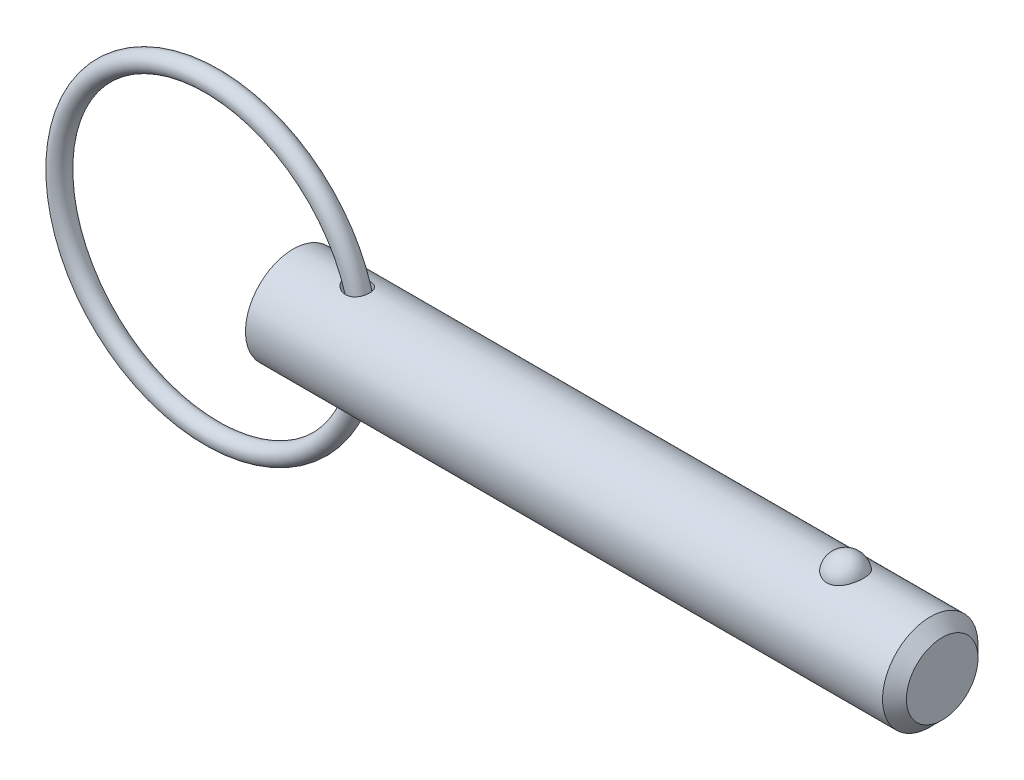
ISO-10303-21;
HEADER;
FILE_DESCRIPTION(('STEP AP214'),'2;1');
FILE_NAME('part.step','',(''),(''),'','','');
FILE_SCHEMA(('AUTOMOTIVE_DESIGN { 1 0 10303 214 1 1 1 1 }'));
ENDSEC;
DATA;
#1=APPLICATION_CONTEXT('core data for automotive mechanical design processes');
#2=APPLICATION_PROTOCOL_DEFINITION('international standard','automotive_design',2000,#1);
#3=PRODUCT_CONTEXT('',#1,'mechanical');
#4=PRODUCT('Part','Part','',(#3));
#5=PRODUCT_RELATED_PRODUCT_CATEGORY('part','',(#4));
#6=PRODUCT_DEFINITION_FORMATION('','',#4);
#7=PRODUCT_DEFINITION_CONTEXT('part definition',#1,'design');
#8=PRODUCT_DEFINITION('design','',#6,#7);
#9=PRODUCT_DEFINITION_SHAPE('','',#8);
#10=(LENGTH_UNIT() NAMED_UNIT(*) SI_UNIT(.MILLI.,.METRE.));
#11=(NAMED_UNIT(*) PLANE_ANGLE_UNIT() SI_UNIT($,.RADIAN.));
#12=(NAMED_UNIT(*) SI_UNIT($,.STERADIAN.) SOLID_ANGLE_UNIT());
#13=UNCERTAINTY_MEASURE_WITH_UNIT(LENGTH_MEASURE(1.E-05),#10,'distance_accuracy_value','');
#14=(GEOMETRIC_REPRESENTATION_CONTEXT(3) GLOBAL_UNCERTAINTY_ASSIGNED_CONTEXT((#13)) GLOBAL_UNIT_ASSIGNED_CONTEXT((#10,
#11,#12)) REPRESENTATION_CONTEXT('',''));
#15=CARTESIAN_POINT('',(0.,0.,0.));
#16=DIRECTION('',(0.,0.,1.));
#17=DIRECTION('',(1.,0.,0.));
#18=AXIS2_PLACEMENT_3D('',#15,#16,#17);
#19=CARTESIAN_POINT('',(-6.75433730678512,0.,0.));
#20=DIRECTION('',(0.,0.,1.));
#21=DIRECTION('',(1.,0.,0.));
#22=AXIS2_PLACEMENT_3D('',#19,#20,#21);
#23=TOROIDAL_SURFACE('',#22,12.7,0.794);
#24=CARTESIAN_POINT('',(6.73966269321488,0.,0.));
#25=VERTEX_POINT('',#24);
#26=VERTEX_LOOP('',#25);
#27=FACE_BOUND('',#26,.T.);
#28=ADVANCED_FACE('P0_F12',(#27),#23,.T.);
#29=CLOSED_SHELL('',(#28));
#30=MANIFOLD_SOLID_BREP('P0_B1',#29);
#31=CARTESIAN_POINT('',(0.,0.,0.));
#32=DIRECTION('',(1.,0.,0.));
#33=DIRECTION('',(0.,0.,-1.));
#34=AXIS2_PLACEMENT_3D('',#31,#32,#33);
#35=CYLINDRICAL_SURFACE('',#34,3.97);
#36=CARTESIAN_POINT('',(4.5061340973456,3.92152479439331,-0.618499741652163));
#37=CARTESIAN_POINT('',(4.54853517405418,3.91408351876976,-0.66567962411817));
#38=CARTESIAN_POINT('',(4.59520918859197,3.90637054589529,-0.709047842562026));
#39=CARTESIAN_POINT('',(4.69529850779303,3.89134328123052,-0.787367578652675));
#40=CARTESIAN_POINT('',(4.74872860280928,3.88402991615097,-0.822300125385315));
#41=CARTESIAN_POINT('',(4.86059505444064,3.87069188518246,-0.882953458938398));
#42=CARTESIAN_POINT('',(4.91902090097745,3.86466460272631,-0.908693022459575));
#43=CARTESIAN_POINT('',(5.03942053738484,3.85463812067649,-0.950329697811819));
#44=CARTESIAN_POINT('',(5.10139227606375,3.85063776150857,-0.966232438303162));
#45=CARTESIAN_POINT('',(5.22799334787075,3.84521819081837,-0.987584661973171));
#46=CARTESIAN_POINT('',(5.29264515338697,3.84382942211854,-0.992910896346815));
#47=CARTESIAN_POINT('',(5.42187784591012,3.84405510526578,-0.992040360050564));
#48=CARTESIAN_POINT('',(5.48645875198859,3.84566813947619,-0.985849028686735));
#49=CARTESIAN_POINT('',(5.60832575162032,3.85155853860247,-0.962561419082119));
#50=CARTESIAN_POINT('',(5.66579014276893,3.85562063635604,-0.946343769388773));
#51=CARTESIAN_POINT('',(5.77675338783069,3.86576598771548,-0.90400447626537));
#52=CARTESIAN_POINT('',(5.83025379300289,3.87184844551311,-0.877886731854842));
#53=CARTESIAN_POINT('',(5.92811265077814,3.88482601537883,-0.818464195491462));
#54=CARTESIAN_POINT('',(5.97284196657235,3.89164057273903,-0.785750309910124));
#55=CARTESIAN_POINT('',(6.05599619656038,3.90559314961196,-0.713164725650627));
#56=CARTESIAN_POINT('',(6.09442162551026,3.91273114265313,-0.673293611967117));
#57=CARTESIAN_POINT('',(6.16349552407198,3.92643411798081,-0.588089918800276));
#58=CARTESIAN_POINT('',(6.19423746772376,3.93300527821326,-0.542833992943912));
#59=CARTESIAN_POINT('',(6.24784048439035,3.94496273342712,-0.447731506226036));
#60=CARTESIAN_POINT('',(6.27070130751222,3.95034899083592,-0.397884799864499));
#61=CARTESIAN_POINT('',(6.30819009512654,3.95940331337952,-0.294515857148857));
#62=CARTESIAN_POINT('',(6.32274046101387,3.96305513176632,-0.240964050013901));
#63=CARTESIAN_POINT('',(6.34295490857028,3.96817541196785,-0.13210707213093));
#64=CARTESIAN_POINT('',(6.34861870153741,3.96964380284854,-0.0768018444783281));
#65=CARTESIAN_POINT('',(6.35094049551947,3.97024250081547,0.0343098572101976));
#66=CARTESIAN_POINT('',(6.34754972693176,3.96936014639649,0.090117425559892));
#67=CARTESIAN_POINT('',(6.33173352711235,3.9653248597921,0.200354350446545));
#68=CARTESIAN_POINT('',(6.31930791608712,3.96217188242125,0.25478367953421));
#69=CARTESIAN_POINT('',(6.28569545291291,3.95393415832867,0.360736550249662));
#70=CARTESIAN_POINT('',(6.26450524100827,3.94884867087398,0.41225896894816));
#71=CARTESIAN_POINT('',(6.21385621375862,3.93730247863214,0.510898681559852));
#72=CARTESIAN_POINT('',(6.18439757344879,3.93084180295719,0.558016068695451));
#73=CARTESIAN_POINT('',(6.11807283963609,3.91729312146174,0.64630042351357));
#74=CARTESIAN_POINT('',(6.08123803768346,3.91020783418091,0.68749130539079));
#75=CARTESIAN_POINT('',(6.00105036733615,3.89618447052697,0.762970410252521));
#76=CARTESIAN_POINT('',(5.95769831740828,3.88924637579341,0.797259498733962));
#77=CARTESIAN_POINT('',(5.86613530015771,3.87636375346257,0.857702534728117));
#78=CARTESIAN_POINT('',(5.81797537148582,3.87041026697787,0.883931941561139));
#79=CARTESIAN_POINT('',(5.71784316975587,3.86006042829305,0.928089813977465));
#80=CARTESIAN_POINT('',(5.66587104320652,3.85566401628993,0.946018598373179));
#81=CARTESIAN_POINT('',(5.55935910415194,3.84884784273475,0.973381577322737));
#82=CARTESIAN_POINT('',(5.50480823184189,3.84643760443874,0.982774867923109));
#83=CARTESIAN_POINT('',(5.39486598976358,3.84381055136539,0.992999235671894));
#84=CARTESIAN_POINT('',(5.33947443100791,3.84359423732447,0.993828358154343));
#85=CARTESIAN_POINT('',(5.2264823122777,3.84533176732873,0.987084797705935));
#86=CARTESIAN_POINT('',(5.16890896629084,3.84739412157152,0.979092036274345));
#87=CARTESIAN_POINT('',(5.05572652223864,3.85355237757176,0.954563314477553));
#88=CARTESIAN_POINT('',(5.00011821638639,3.85764908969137,0.938023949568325));
#89=CARTESIAN_POINT('',(4.88760177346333,3.86780726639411,0.8952592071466));
#90=CARTESIAN_POINT('',(4.83096658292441,3.87400321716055,0.868345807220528));
#91=CARTESIAN_POINT('',(4.72283286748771,3.88749324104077,0.805802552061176));
#92=CARTESIAN_POINT('',(4.67133743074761,3.89478796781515,0.770167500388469));
#93=CARTESIAN_POINT('',(4.57320957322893,3.90992457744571,0.689306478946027));
#94=CARTESIAN_POINT('',(4.52683185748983,3.91777672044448,0.643771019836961));
#95=CARTESIAN_POINT('',(4.44324307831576,3.93275681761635,0.544809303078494));
#96=CARTESIAN_POINT('',(4.40602610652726,3.939885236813,0.491388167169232));
#97=CARTESIAN_POINT('',(4.34571986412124,3.95183347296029,0.382912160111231));
#98=CARTESIAN_POINT('',(4.32168268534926,3.95680025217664,0.32840447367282));
#99=CARTESIAN_POINT('',(4.28478280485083,3.96454157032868,0.215602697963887));
#100=CARTESIAN_POINT('',(4.27190231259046,3.96731959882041,0.157314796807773));
#101=CARTESIAN_POINT('',(4.25937356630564,3.97002560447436,0.0481762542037));
#102=CARTESIAN_POINT('',(4.25802727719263,3.97031923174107,-0.0024752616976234));
#103=CARTESIAN_POINT('',(4.26422295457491,3.96897737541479,-0.103210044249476));
#104=CARTESIAN_POINT('',(4.27176468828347,3.96734194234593,-0.15329332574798));
#105=CARTESIAN_POINT('',(4.29457390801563,3.96248430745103,-0.24853074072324));
#106=CARTESIAN_POINT('',(4.30937736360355,3.95935769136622,-0.293803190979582));
#107=CARTESIAN_POINT('',(4.34569993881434,3.95187968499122,-0.381417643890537));
#108=CARTESIAN_POINT('',(4.36721517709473,3.94752900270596,-0.423761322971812));
#109=CARTESIAN_POINT('',(4.40821696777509,3.93952317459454,-0.491758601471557));
#110=CARTESIAN_POINT('',(4.42613511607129,3.93609353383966,-0.518404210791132));
#111=CARTESIAN_POINT('',(4.46438343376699,3.92897396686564,-0.569857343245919));
#112=CARTESIAN_POINT('',(4.48471350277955,3.92528405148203,-0.594664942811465));
#113=CARTESIAN_POINT('',(4.5061340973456,3.92152479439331,-0.618499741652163));
#114=B_SPLINE_CURVE_WITH_KNOTS('',3,(#36,#37,#38,#39,#40,#41,#42,#43,#44,#45,#46,#47,#48,#49,
#50,#51,#52,#53,#54,#55,#56,#57,#58,#59,#60,#61,#62,#63,#64,#65,#66,#67,#68,#69,#70,#71,#72,#73,
#74,#75,#76,#77,#78,#79,#80,#81,#82,#83,#84,#85,#86,#87,#88,#89,#90,#91,#92,#93,#94,#95,#96,#97,
#98,#99,#100,#101,#102,#103,#104,#105,#106,#107,#108,#109,#110,#111,#112,#113),.UNSPECIFIED.,
.T.,.F.,(4,2,2,2,2,2,2,2,2,2,2,2,2,2,2,2,2,2,2,2,2,2,2,2,2,2,2,2,2,2,2,2,2,2,2,2,2,2,4),(0.,
0.191481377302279,0.383389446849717,0.574903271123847,0.766307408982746,0.959929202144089,
1.15345957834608,1.33205157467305,1.51057330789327,1.67726576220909,1.84394459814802,
2.00848443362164,2.17302948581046,2.33908685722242,2.50514962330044,2.6721086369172,
2.83907097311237,3.00609737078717,3.17312023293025,3.33944900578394,3.5057569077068,
3.67045663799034,3.83515004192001,4.00062859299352,4.16614491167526,4.33989638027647,
4.51371711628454,4.70191549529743,4.8902262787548,5.0855971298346,5.28084164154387,
5.45908728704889,5.63704817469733,5.78825771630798,5.93946329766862,6.08206496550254,
6.22458432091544,6.32132279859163,6.41805725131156),.UNSPECIFIED.);
#115=CARTESIAN_POINT('',(4.5061340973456,3.92152479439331,-0.618499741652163));
#116=VERTEX_POINT('',#115);
#117=EDGE_CURVE('P1_E40',#116,#116,#114,.T.);
#118=ORIENTED_EDGE('',*,*,#117,.T.);
#119=EDGE_LOOP('',(#118));
#120=FACE_BOUND('',#119,.T.);
#121=CARTESIAN_POINT('',(52.9875,0.,0.));
#122=DIRECTION('',(1.,0.,0.));
#123=DIRECTION('',(0.,0.,-1.));
#124=AXIS2_PLACEMENT_3D('',#121,#122,#123);
#125=CIRCLE('',#124,3.97);
#126=CARTESIAN_POINT('',(52.9875,0.,-3.97));
#127=VERTEX_POINT('',#126);
#128=EDGE_CURVE('P1_E25',#127,#127,#125,.T.);
#129=ORIENTED_EDGE('',*,*,#128,.F.);
#130=EDGE_LOOP('',(#129));
#131=FACE_BOUND('',#130,.T.);
#132=CARTESIAN_POINT('',(0.,0.,0.));
#133=DIRECTION('',(1.,0.,0.));
#134=DIRECTION('',(0.,0.,-1.));
#135=AXIS2_PLACEMENT_3D('',#132,#133,#134);
#136=CIRCLE('',#135,3.97);
#137=CARTESIAN_POINT('',(0.,0.,-3.97));
#138=VERTEX_POINT('',#137);
#139=EDGE_CURVE('P1_E9',#138,#138,#136,.T.);
#140=ORIENTED_EDGE('',*,*,#139,.T.);
#141=EDGE_LOOP('',(#140));
#142=FACE_BOUND('',#141,.T.);
#143=CARTESIAN_POINT('',(45.9451922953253,3.65715365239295,1.54470941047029));
#144=CARTESIAN_POINT('',(45.8652448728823,3.65716001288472,1.5447029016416));
#145=CARTESIAN_POINT('',(45.7851650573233,3.65987074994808,1.53832549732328));
#146=CARTESIAN_POINT('',(45.6272374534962,3.6704221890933,1.51297018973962));
#147=CARTESIAN_POINT('',(45.5493961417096,3.67827646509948,1.49395894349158));
#148=CARTESIAN_POINT('',(45.3984614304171,3.69818848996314,1.44395950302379));
#149=CARTESIAN_POINT('',(45.3253560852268,3.71023513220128,1.41300293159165));
#150=CARTESIAN_POINT('',(45.1855630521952,3.7372183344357,1.34000212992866));
#151=CARTESIAN_POINT('',(45.1188725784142,3.75215363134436,1.29796274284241));
#152=CARTESIAN_POINT('',(44.99148864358,3.78384968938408,1.20248834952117));
#153=CARTESIAN_POINT('',(44.9310299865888,3.80065129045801,1.14875388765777));
#154=CARTESIAN_POINT('',(44.8196942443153,3.83398532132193,1.03205417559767));
#155=CARTESIAN_POINT('',(44.7688200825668,3.85051766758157,0.969086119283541));
#156=CARTESIAN_POINT('',(44.6756321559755,3.88238608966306,0.832526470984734));
#157=CARTESIAN_POINT('',(44.6337961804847,3.89763698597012,0.758588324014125));
#158=CARTESIAN_POINT('',(44.5625108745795,3.92451063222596,0.604352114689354));
#159=CARTESIAN_POINT('',(44.5330623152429,3.93613315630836,0.52405365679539));
#160=CARTESIAN_POINT('',(44.4868927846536,3.95467606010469,0.358403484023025));
#161=CARTESIAN_POINT('',(44.4703127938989,3.96154426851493,0.273006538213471));
#162=CARTESIAN_POINT('',(44.450756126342,3.96967008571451,0.100408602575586));
#163=CARTESIAN_POINT('',(44.4477789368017,3.97092790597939,0.0132076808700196));
#164=CARTESIAN_POINT('',(44.4554587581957,3.96771794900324,-0.159844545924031));
#165=CARTESIAN_POINT('',(44.4660164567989,3.96329187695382,-0.245701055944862));
#166=CARTESIAN_POINT('',(44.5003800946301,3.94923163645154,-0.414277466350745));
#167=CARTESIAN_POINT('',(44.5241862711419,3.93959737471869,-0.496997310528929));
#168=CARTESIAN_POINT('',(44.5846114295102,3.91607752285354,-0.657113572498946));
#169=CARTESIAN_POINT('',(44.6212495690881,3.90218558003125,-0.734501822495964));
#170=CARTESIAN_POINT('',(44.7065935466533,3.87158287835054,-0.881704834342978));
#171=CARTESIAN_POINT('',(44.7553004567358,3.8548718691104,-0.951518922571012));
#172=CARTESIAN_POINT('',(44.8641161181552,3.82028735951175,-1.08208159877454));
#173=CARTESIAN_POINT('',(44.9242955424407,3.80240713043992,-1.14276958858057));
#174=CARTESIAN_POINT('',(45.054493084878,3.76758161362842,-1.2528243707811));
#175=CARTESIAN_POINT('',(45.1245105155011,3.75063626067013,-1.30219195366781));
#176=CARTESIAN_POINT('',(45.27118160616,3.71998948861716,-1.38729709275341));
#177=CARTESIAN_POINT('',(45.3476813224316,3.70623183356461,-1.42327904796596));
#178=CARTESIAN_POINT('',(45.5062981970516,3.68323188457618,-1.48178996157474));
#179=CARTESIAN_POINT('',(45.5884132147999,3.67398788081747,-1.50432401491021));
#180=CARTESIAN_POINT('',(45.7514810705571,3.6615216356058,-1.53440939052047));
#181=CARTESIAN_POINT('',(45.8322840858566,3.65801951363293,-1.54265826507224));
#182=CARTESIAN_POINT('',(45.9942085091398,3.65657341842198,-1.5460842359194));
#183=CARTESIAN_POINT('',(46.0753298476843,3.65862829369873,-1.54126404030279));
#184=CARTESIAN_POINT('',(46.2328122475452,3.66788969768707,-1.51908474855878));
#185=CARTESIAN_POINT('',(46.3092422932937,3.67492621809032,-1.50213925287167));
#186=CARTESIAN_POINT('',(46.4580412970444,3.69318404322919,-1.45666982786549));
#187=CARTESIAN_POINT('',(46.5304099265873,3.70440568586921,-1.42814496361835));
#188=CARTESIAN_POINT('',(46.6708029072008,3.73012749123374,-1.35956319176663));
#189=CARTESIAN_POINT('',(46.7387000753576,3.74469307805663,-1.31927107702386));
#190=CARTESIAN_POINT('',(46.8668649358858,3.77545272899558,-1.22847440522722));
#191=CARTESIAN_POINT('',(46.9271308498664,3.79164717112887,-1.17796747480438));
#192=CARTESIAN_POINT('',(47.0416346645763,3.82490325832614,-1.06519260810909));
#193=CARTESIAN_POINT('',(47.0954137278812,3.84196735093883,-1.00245914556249));
#194=CARTESIAN_POINT('',(47.1920988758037,3.87439863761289,-0.868715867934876));
#195=CARTESIAN_POINT('',(47.2350030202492,3.88976552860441,-0.797704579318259));
#196=CARTESIAN_POINT('',(47.310266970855,3.91771381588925,-0.646896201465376));
#197=CARTESIAN_POINT('',(47.3422532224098,3.93019255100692,-0.566893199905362));
#198=CARTESIAN_POINT('',(47.3931101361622,3.95043886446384,-0.402255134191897));
#199=CARTESIAN_POINT('',(47.4119807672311,3.95820643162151,-0.317620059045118));
#200=CARTESIAN_POINT('',(47.4362162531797,3.96823733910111,-0.146156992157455));
#201=CARTESIAN_POINT('',(47.4415874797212,3.970503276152,-0.0593300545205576));
#202=CARTESIAN_POINT('',(47.438730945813,3.96930811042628,0.114057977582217));
#203=CARTESIAN_POINT('',(47.4305035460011,3.9658471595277,0.200619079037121));
#204=CARTESIAN_POINT('',(47.4007063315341,3.95358562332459,0.370506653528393));
#205=CARTESIAN_POINT('',(47.3792129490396,3.94481563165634,0.453848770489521));
#206=CARTESIAN_POINT('',(47.3233839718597,3.92284586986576,0.615497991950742));
#207=CARTESIAN_POINT('',(47.2890474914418,3.90964579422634,0.693804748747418));
#208=CARTESIAN_POINT('',(47.2079702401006,3.88006987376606,0.843703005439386));
#209=CARTESIAN_POINT('',(47.1611536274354,3.86367478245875,0.915249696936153));
#210=CARTESIAN_POINT('',(47.0561897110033,3.82949741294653,1.04910810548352));
#211=CARTESIAN_POINT('',(46.9980428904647,3.81171519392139,1.11142021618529));
#212=CARTESIAN_POINT('',(46.8717433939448,3.77673366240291,1.22503948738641));
#213=CARTESIAN_POINT('',(46.8035970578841,3.75953398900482,1.27635357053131));
#214=CARTESIAN_POINT('',(46.6589009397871,3.72770506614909,1.36653336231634));
#215=CARTESIAN_POINT('',(46.582348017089,3.71307678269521,1.40539439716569));
#216=CARTESIAN_POINT('',(46.4257594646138,3.68864287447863,1.46830480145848));
#217=CARTESIAN_POINT('',(46.3459307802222,3.67869017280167,1.49281289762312));
#218=CARTESIAN_POINT('',(46.1829877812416,3.66414535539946,1.52817474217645));
#219=CARTESIAN_POINT('',(46.0998840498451,3.65953723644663,1.53906926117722));
#220=CARTESIAN_POINT('',(45.9927760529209,3.6573894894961,1.54414878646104));
#221=CARTESIAN_POINT('',(45.9689900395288,3.65715175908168,1.54471134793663));
#222=CARTESIAN_POINT('',(45.9451922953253,3.65715365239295,1.54470941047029));
#223=B_SPLINE_CURVE_WITH_KNOTS('',3,(#143,#144,#145,#146,#147,#148,#149,#150,#151,#152,#153,
#154,#155,#156,#157,#158,#159,#160,#161,#162,#163,#164,#165,#166,#167,#168,#169,#170,#171,#172,
#173,#174,#175,#176,#177,#178,#179,#180,#181,#182,#183,#184,#185,#186,#187,#188,#189,#190,#191,
#192,#193,#194,#195,#196,#197,#198,#199,#200,#201,#202,#203,#204,#205,#206,#207,#208,#209,#210,
#211,#212,#213,#214,#215,#216,#217,#218,#219,#220,#221,#222),.UNSPECIFIED.,.T.,.F.,(4,2,2,2,2,2,
2,2,2,2,2,2,2,2,2,2,2,2,2,2,2,2,2,2,2,2,2,2,2,2,2,2,2,2,2,2,2,2,2,4),(0.,0.239777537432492,
0.480190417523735,0.71997117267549,0.959647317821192,1.20639040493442,1.45320863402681,
1.7109367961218,1.96868099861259,2.2292105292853,2.48973023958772,2.74834928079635,
3.00697295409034,3.26598440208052,3.52501886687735,3.78570385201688,4.04637062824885,
4.30201257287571,4.55755760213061,4.80022994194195,5.0428520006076,5.27757006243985,
5.51230707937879,5.75210128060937,5.99195126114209,6.24392810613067,6.49594987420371,
6.75588818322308,7.01582710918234,7.27564332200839,7.53545264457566,7.79377886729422,
8.05212290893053,8.31207418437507,8.57201437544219,8.8317904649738,9.09166393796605,
9.34270057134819,9.59298357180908,9.66435753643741),.UNSPECIFIED.);
#224=CARTESIAN_POINT('',(45.9451922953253,3.65715365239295,1.54470941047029));
#225=VERTEX_POINT('',#224);
#226=EDGE_CURVE('P1_E34',#225,#225,#223,.T.);
#227=ORIENTED_EDGE('',*,*,#226,.T.);
#228=EDGE_LOOP('',(#227));
#229=FACE_BOUND('',#228,.T.);
#230=CARTESIAN_POINT('',(4.5061340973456,-3.92152479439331,-0.618499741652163));
#231=CARTESIAN_POINT('',(4.47063221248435,-3.92775524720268,-0.578995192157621));
#232=CARTESIAN_POINT('',(4.43810149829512,-3.93379908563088,-0.536794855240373));
#233=CARTESIAN_POINT('',(4.38017497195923,-3.94493883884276,-0.447628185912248));
#234=CARTESIAN_POINT('',(4.35477467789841,-3.95003534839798,-0.400664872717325));
#235=CARTESIAN_POINT('',(4.31221789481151,-3.95875465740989,-0.302642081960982));
#236=CARTESIAN_POINT('',(4.29511088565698,-3.96236859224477,-0.251560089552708));
#237=CARTESIAN_POINT('',(4.27046538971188,-3.96762012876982,-0.147036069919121));
#238=CARTESIAN_POINT('',(4.26292104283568,-3.96925894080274,-0.0935955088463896));
#239=CARTESIAN_POINT('',(4.25814817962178,-3.97029345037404,0.00916757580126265));
#240=CARTESIAN_POINT('',(4.26009234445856,-3.96986905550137,0.058451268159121));
#241=CARTESIAN_POINT('',(4.27229463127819,-3.96723648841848,0.155921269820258));
#242=CARTESIAN_POINT('',(4.28255257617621,-3.96502835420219,0.204107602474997));
#243=CARTESIAN_POINT('',(4.3104038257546,-3.95915538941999,0.296804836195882));
#244=CARTESIAN_POINT('',(4.32779766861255,-3.95553028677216,0.341378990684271));
#245=CARTESIAN_POINT('',(4.36906896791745,-3.94717481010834,0.427290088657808));
#246=CARTESIAN_POINT('',(4.3929482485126,-3.94244412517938,0.468626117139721));
#247=CARTESIAN_POINT('',(4.44891306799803,-3.93178155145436,0.551268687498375));
#248=CARTESIAN_POINT('',(4.48157347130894,-3.92577737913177,0.592175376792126));
#249=CARTESIAN_POINT('',(4.55251112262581,-3.91346489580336,0.668729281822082));
#250=CARTESIAN_POINT('',(4.59079150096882,-3.90715641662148,0.704373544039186));
#251=CARTESIAN_POINT('',(4.67775521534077,-3.89387548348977,0.774654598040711));
#252=CARTESIAN_POINT('',(4.72714377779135,-3.88693620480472,0.808427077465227));
#253=CARTESIAN_POINT('',(4.83064277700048,-3.8740635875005,0.868022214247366));
#254=CARTESIAN_POINT('',(4.88475591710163,-3.86813083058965,0.893840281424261));
#255=CARTESIAN_POINT('',(5.00110106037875,-3.85749476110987,0.938729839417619));
#256=CARTESIAN_POINT('',(5.06363405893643,-3.85293457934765,0.957062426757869));
#257=CARTESIAN_POINT('',(5.19104406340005,-3.84642688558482,0.98289453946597));
#258=CARTESIAN_POINT('',(5.2559205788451,-3.84447883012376,0.990396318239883));
#259=CARTESIAN_POINT('',(5.38389367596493,-3.84360582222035,0.993779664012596));
#260=CARTESIAN_POINT('',(5.44697893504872,-3.84458391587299,0.990033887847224));
#261=CARTESIAN_POINT('',(5.57135239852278,-3.84935403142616,0.971322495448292));
#262=CARTESIAN_POINT('',(5.63264168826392,-3.85314431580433,0.956363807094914));
#263=CARTESIAN_POINT('',(5.74616757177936,-3.86267246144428,0.917075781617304));
#264=CARTESIAN_POINT('',(5.79873169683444,-3.86821908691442,0.893643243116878));
#265=CARTESIAN_POINT('',(5.89880370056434,-3.88065529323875,0.837987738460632));
#266=CARTESIAN_POINT('',(5.94631268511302,-3.88754457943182,0.805766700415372));
#267=CARTESIAN_POINT('',(6.03285109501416,-3.90151699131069,0.735052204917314));
#268=CARTESIAN_POINT('',(6.07216200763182,-3.90857818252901,0.696897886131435));
#269=CARTESIAN_POINT('',(6.14379115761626,-3.92238187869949,0.614461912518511));
#270=CARTESIAN_POINT('',(6.17610956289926,-3.92912439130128,0.570180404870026));
#271=CARTESIAN_POINT('',(6.23298117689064,-3.94155789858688,0.476700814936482));
#272=CARTESIAN_POINT('',(6.25752764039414,-3.94724797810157,0.427498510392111));
#273=CARTESIAN_POINT('',(6.29825018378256,-3.95695712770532,0.325589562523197));
#274=CARTESIAN_POINT('',(6.3144259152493,-3.96097612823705,0.272882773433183));
#275=CARTESIAN_POINT('',(6.33815165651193,-3.96694319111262,0.164947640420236));
#276=CARTESIAN_POINT('',(6.34562253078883,-3.96887224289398,0.10970083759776));
#277=CARTESIAN_POINT('',(6.35150690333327,-3.97038782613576,-0.00130546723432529));
#278=CARTESIAN_POINT('',(6.34992017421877,-3.96997429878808,-0.057064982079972));
#279=CARTESIAN_POINT('',(6.33770614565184,-3.96684417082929,-0.16768512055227));
#280=CARTESIAN_POINT('',(6.32705245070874,-3.96412084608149,-0.222542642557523));
#281=CARTESIAN_POINT('',(6.29690849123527,-3.95665587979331,-0.329631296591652));
#282=CARTESIAN_POINT('',(6.27741810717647,-3.95191421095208,-0.381862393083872));
#283=CARTESIAN_POINT('',(6.2300755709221,-3.94093577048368,-0.482151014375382));
#284=CARTESIAN_POINT('',(6.20223216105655,-3.93470056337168,-0.530212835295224));
#285=CARTESIAN_POINT('',(6.13885089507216,-3.92142345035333,-0.620836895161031));
#286=CARTESIAN_POINT('',(6.10331353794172,-3.9143815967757,-0.663399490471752));
#287=CARTESIAN_POINT('',(6.02573506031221,-3.90033441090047,-0.741525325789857));
#288=CARTESIAN_POINT('',(5.9837408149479,-3.89332916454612,-0.777135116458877));
#289=CARTESIAN_POINT('',(5.8942293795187,-3.88009391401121,-0.840731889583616));
#290=CARTESIAN_POINT('',(5.84671289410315,-3.87386381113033,-0.868719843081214));
#291=CARTESIAN_POINT('',(5.74792005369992,-3.86290904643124,-0.916201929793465));
#292=CARTESIAN_POINT('',(5.69667597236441,-3.85817300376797,-0.935760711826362));
#293=CARTESIAN_POINT('',(5.59158164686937,-3.85061943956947,-0.966374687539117));
#294=CARTESIAN_POINT('',(5.53773121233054,-3.84780205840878,-0.97742925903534));
#295=CARTESIAN_POINT('',(5.42780663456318,-3.84428235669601,-0.991183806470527));
#296=CARTESIAN_POINT('',(5.37170954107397,-3.84362414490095,-0.993709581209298));
#297=CARTESIAN_POINT('',(5.2598091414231,-3.84452352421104,-0.990222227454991));
#298=CARTESIAN_POINT('',(5.20400591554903,-3.84608169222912,-0.984206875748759));
#299=CARTESIAN_POINT('',(5.0902194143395,-3.85134557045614,-0.963410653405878));
#300=CARTESIAN_POINT('',(5.03234703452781,-3.85519050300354,-0.948059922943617));
#301=CARTESIAN_POINT('',(4.91972924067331,-3.86464451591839,-0.908751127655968));
#302=CARTESIAN_POINT('',(4.86498619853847,-3.87025491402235,-0.884786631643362));
#303=CARTESIAN_POINT('',(4.75497621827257,-3.88320265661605,-0.826208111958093));
#304=CARTESIAN_POINT('',(4.70013922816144,-3.89065244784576,-0.790807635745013));
#305=CARTESIAN_POINT('',(4.59743373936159,-3.90600301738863,-0.711112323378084));
#306=CARTESIAN_POINT('',(4.54956105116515,-3.91390352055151,-0.666822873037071));
#307=CARTESIAN_POINT('',(4.5061340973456,-3.92152479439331,-0.618499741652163));
#308=B_SPLINE_CURVE_WITH_KNOTS('',3,(#230,#231,#232,#233,#234,#235,#236,#237,#238,#239,#240,
#241,#242,#243,#244,#245,#246,#247,#248,#249,#250,#251,#252,#253,#254,#255,#256,#257,#258,#259,
#260,#261,#262,#263,#264,#265,#266,#267,#268,#269,#270,#271,#272,#273,#274,#275,#276,#277,#278,
#279,#280,#281,#282,#283,#284,#285,#286,#287,#288,#289,#290,#291,#292,#293,#294,#295,#296,#297,
#298,#299,#300,#301,#302,#303,#304,#305,#306,#307),.UNSPECIFIED.,.T.,.F.,(4,2,2,2,2,2,2,2,2,2,2,
2,2,2,2,2,2,2,2,2,2,2,2,2,2,2,2,2,2,2,2,2,2,2,2,2,2,2,4),(0.,0.160252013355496,
0.320403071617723,0.481498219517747,0.642494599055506,0.78971746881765,0.936937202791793,
1.08029540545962,1.22369397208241,1.38114509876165,1.53868426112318,1.7186296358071,
1.89867865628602,2.09368931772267,2.28865940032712,2.47724174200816,2.66570766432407,
2.83827720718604,3.01080892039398,3.17573461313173,3.34065634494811,3.50572082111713,
3.67079216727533,3.83735274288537,4.00391749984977,4.17096882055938,4.33802240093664,
4.50490174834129,4.6717702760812,4.83748008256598,5.0031687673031,5.16756302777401,
5.3319693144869,5.49971393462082,5.66750222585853,5.84673431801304,6.02610050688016,
6.22224398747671,6.41826898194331),.UNSPECIFIED.);
#309=CARTESIAN_POINT('',(4.5061340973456,-3.92152479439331,-0.618499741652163));
#310=VERTEX_POINT('',#309);
#311=EDGE_CURVE('P1_E17',#310,#310,#308,.T.);
#312=ORIENTED_EDGE('',*,*,#311,.T.);
#313=EDGE_LOOP('',(#312));
#314=FACE_BOUND('',#313,.T.);
#315=ADVANCED_FACE('P1_F13',(#120,#131,#142,#229,#314),#35,.T.);
#316=CARTESIAN_POINT('',(0.,0.,0.));
#317=DIRECTION('',(-1.,0.,0.));
#318=DIRECTION('',(0.,0.,1.));
#319=AXIS2_PLACEMENT_3D('',#316,#317,#318);
#320=PLANE('',#319);
#321=ORIENTED_EDGE('',*,*,#139,.F.);
#322=EDGE_LOOP('',(#321));
#323=FACE_BOUND('',#322,.T.);
#324=ADVANCED_FACE('P1_F15',(#323),#320,.T.);
#325=CARTESIAN_POINT('',(53.98,0.,0.));
#326=DIRECTION('',(-1.,0.,0.));
#327=DIRECTION('',(0.,0.,1.));
#328=AXIS2_PLACEMENT_3D('',#325,#326,#327);
#329=CONICAL_SURFACE('',#328,2.97750000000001,0.785398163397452);
#330=ORIENTED_EDGE('',*,*,#128,.T.);
#331=EDGE_LOOP('',(#330));
#332=FACE_BOUND('',#331,.T.);
#333=CARTESIAN_POINT('',(53.98,0.,0.));
#334=DIRECTION('',(1.,0.,0.));
#335=DIRECTION('',(0.,0.,-1.));
#336=AXIS2_PLACEMENT_3D('',#333,#334,#335);
#337=CIRCLE('',#336,2.97750000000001);
#338=CARTESIAN_POINT('',(53.98,0.,-2.97750000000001));
#339=VERTEX_POINT('',#338);
#340=EDGE_CURVE('P1_E30',#339,#339,#337,.T.);
#341=ORIENTED_EDGE('',*,*,#340,.F.);
#342=EDGE_LOOP('',(#341));
#343=FACE_BOUND('',#342,.T.);
#344=ADVANCED_FACE('P1_F55',(#332,#343),#329,.T.);
#345=CARTESIAN_POINT('',(53.98,2.97750000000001,0.));
#346=DIRECTION('',(1.,0.,0.));
#347=DIRECTION('',(0.,0.,-1.));
#348=AXIS2_PLACEMENT_3D('',#345,#346,#347);
#349=PLANE('',#348);
#350=ORIENTED_EDGE('',*,*,#340,.T.);
#351=EDGE_LOOP('',(#350));
#352=FACE_BOUND('',#351,.T.);
#353=ADVANCED_FACE('P1_F51',(#352),#349,.T.);
#354=CARTESIAN_POINT('',(45.9451922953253,3.573,0.));
#355=DIRECTION('',(-1.,0.,0.));
#356=DIRECTION('',(0.,1.,0.));
#357=AXIS2_PLACEMENT_3D('',#354,#355,#356);
#358=SPHERICAL_SURFACE('',#357,1.547);
#359=ORIENTED_EDGE('',*,*,#226,.F.);
#360=EDGE_LOOP('',(#359));
#361=FACE_BOUND('',#360,.T.);
#362=ADVANCED_FACE('P1_F46',(#361),#358,.T.);
#363=CARTESIAN_POINT('',(-6.75433730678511,0.,0.));
#364=DIRECTION('',(0.,0.,1.));
#365=DIRECTION('',(1.,0.,0.));
#366=AXIS2_PLACEMENT_3D('',#363,#364,#365);
#367=TOROIDAL_SURFACE('',#366,12.7,0.9925);
#368=ORIENTED_EDGE('',*,*,#311,.F.);
#369=EDGE_LOOP('',(#368));
#370=FACE_BOUND('',#369,.T.);
#371=ORIENTED_EDGE('',*,*,#117,.F.);
#372=EDGE_LOOP('',(#371));
#373=FACE_BOUND('',#372,.T.);
#374=ADVANCED_FACE('P1_F50',(#370,#373),#367,.F.);
#375=CLOSED_SHELL('',(#315,#324,#344,#353,#362,#374));
#376=MANIFOLD_SOLID_BREP('P1_B1',#375);
#377=ADVANCED_BREP_SHAPE_REPRESENTATION('',(#18,#30,#376),#14);
#378=SHAPE_DEFINITION_REPRESENTATION(#9,#377);
ENDSEC;
END-ISO-10303-21;
